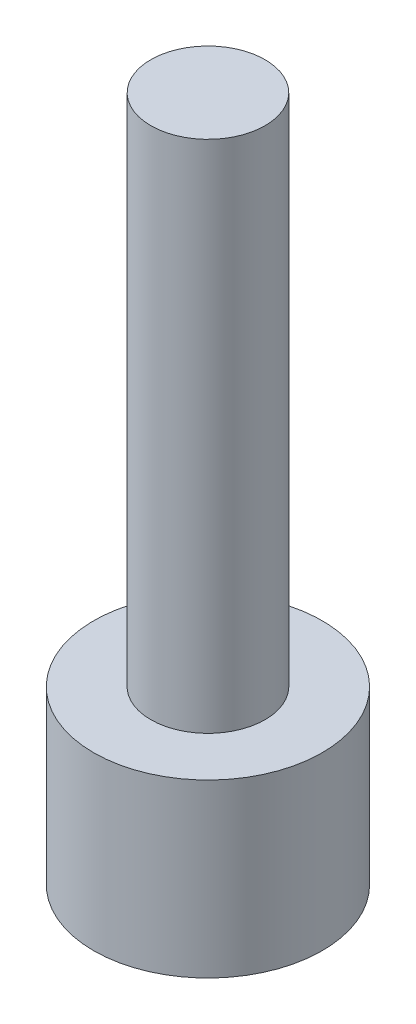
from build123d import *

# Parameters (mm, degrees)
ESQUISSE1_R      = 2
EXTRUSION1_DEPTH = 3
ESQUISSE2_R      = 1
EXTRUSION2_DEPTH = 9


with BuildPart() as part:
    # Esquisse1 → Extrusion1 (new body)
    with BuildSketch(Plane(origin=(0, 0, 0), x_dir=(1, 0, 0), z_dir=(0, 1, 0))):
        with Locations(Location((0, 0, 0), (0, 0, 270))):
            Circle(ESQUISSE1_R)
    extrude(amount=EXTRUSION1_DEPTH)

    # Esquisse2 → Extrusion2 (add)
    with BuildSketch(Plane(origin=(0, 3, 0), x_dir=(-1, 0, 0), z_dir=(0, 1, 0))):
        with Locations(Location((0, 0, 0), (0, 0, 90))):
            Circle(ESQUISSE2_R)
    extrude(amount=EXTRUSION2_DEPTH)


solid = part.part
